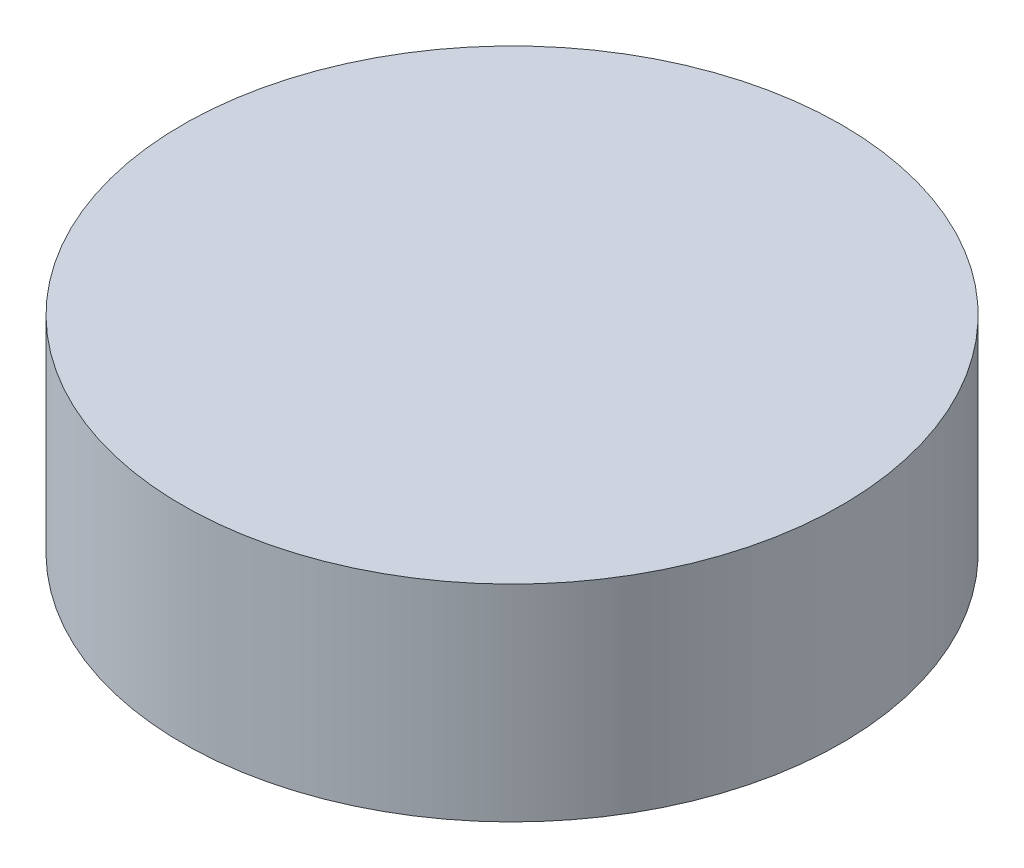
ISO-10303-21;
HEADER;
FILE_DESCRIPTION(('STEP AP214'),'2;1');
FILE_NAME('part.step','',(''),(''),'','','');
FILE_SCHEMA(('AUTOMOTIVE_DESIGN { 1 0 10303 214 1 1 1 1 }'));
ENDSEC;
DATA;
#1=APPLICATION_CONTEXT('core data for automotive mechanical design processes');
#2=APPLICATION_PROTOCOL_DEFINITION('international standard','automotive_design',2000,#1);
#3=PRODUCT_CONTEXT('',#1,'mechanical');
#4=PRODUCT('Part','Part','',(#3));
#5=PRODUCT_RELATED_PRODUCT_CATEGORY('part','',(#4));
#6=PRODUCT_DEFINITION_FORMATION('','',#4);
#7=PRODUCT_DEFINITION_CONTEXT('part definition',#1,'design');
#8=PRODUCT_DEFINITION('design','',#6,#7);
#9=PRODUCT_DEFINITION_SHAPE('','',#8);
#10=(LENGTH_UNIT() NAMED_UNIT(*) SI_UNIT(.MILLI.,.METRE.));
#11=(NAMED_UNIT(*) PLANE_ANGLE_UNIT() SI_UNIT($,.RADIAN.));
#12=(NAMED_UNIT(*) SI_UNIT($,.STERADIAN.) SOLID_ANGLE_UNIT());
#13=UNCERTAINTY_MEASURE_WITH_UNIT(LENGTH_MEASURE(1.E-05),#10,'distance_accuracy_value','');
#14=(GEOMETRIC_REPRESENTATION_CONTEXT(3) GLOBAL_UNCERTAINTY_ASSIGNED_CONTEXT((#13)) GLOBAL_UNIT_ASSIGNED_CONTEXT((#10,
#11,#12)) REPRESENTATION_CONTEXT('',''));
#15=CARTESIAN_POINT('',(0.,0.,0.));
#16=DIRECTION('',(0.,0.,1.));
#17=DIRECTION('',(1.,0.,0.));
#18=AXIS2_PLACEMENT_3D('',#15,#16,#17);
#19=CARTESIAN_POINT('',(8.,5.,0.));
#20=DIRECTION('',(0.,1.,0.));
#21=DIRECTION('',(0.,0.,1.));
#22=AXIS2_PLACEMENT_3D('',#19,#20,#21);
#23=PLANE('',#22);
#24=CARTESIAN_POINT('',(0.,5.,0.));
#25=DIRECTION('',(0.,-1.,0.));
#26=DIRECTION('',(0.,0.,-1.));
#27=AXIS2_PLACEMENT_3D('',#24,#25,#26);
#28=CIRCLE('',#27,8.);
#29=CARTESIAN_POINT('',(0.,5.,-8.));
#30=VERTEX_POINT('',#29);
#31=EDGE_CURVE('E10',#30,#30,#28,.T.);
#32=ORIENTED_EDGE('',*,*,#31,.F.);
#33=EDGE_LOOP('',(#32));
#34=FACE_BOUND('',#33,.T.);
#35=ADVANCED_FACE('F20',(#34),#23,.T.);
#36=CARTESIAN_POINT('',(0.,0.,0.));
#37=DIRECTION('',(0.,-1.,0.));
#38=DIRECTION('',(0.,0.,-1.));
#39=AXIS2_PLACEMENT_3D('',#36,#37,#38);
#40=CYLINDRICAL_SURFACE('',#39,8.);
#41=ORIENTED_EDGE('',*,*,#31,.T.);
#42=EDGE_LOOP('',(#41));
#43=FACE_BOUND('',#42,.T.);
#44=CARTESIAN_POINT('',(0.,0.,0.));
#45=DIRECTION('',(0.,-1.,0.));
#46=DIRECTION('',(0.,0.,-1.));
#47=AXIS2_PLACEMENT_3D('',#44,#45,#46);
#48=CIRCLE('',#47,8.);
#49=CARTESIAN_POINT('',(0.,0.,-8.));
#50=VERTEX_POINT('',#49);
#51=EDGE_CURVE('E26',#50,#50,#48,.T.);
#52=ORIENTED_EDGE('',*,*,#51,.F.);
#53=EDGE_LOOP('',(#52));
#54=FACE_BOUND('',#53,.T.);
#55=ADVANCED_FACE('F34',(#43,#54),#40,.T.);
#56=CARTESIAN_POINT('',(0.,0.,0.));
#57=DIRECTION('',(0.,-1.,0.));
#58=DIRECTION('',(0.,0.,-1.));
#59=AXIS2_PLACEMENT_3D('',#56,#57,#58);
#60=PLANE('',#59);
#61=ORIENTED_EDGE('',*,*,#51,.T.);
#62=EDGE_LOOP('',(#61));
#63=FACE_BOUND('',#62,.T.);
#64=ADVANCED_FACE('F32',(#63),#60,.T.);
#65=CLOSED_SHELL('',(#35,#55,#64));
#66=MANIFOLD_SOLID_BREP('B2',#65);
#67=ADVANCED_BREP_SHAPE_REPRESENTATION('',(#18,#66),#14);
#68=SHAPE_DEFINITION_REPRESENTATION(#9,#67);
ENDSEC;
END-ISO-10303-21;
